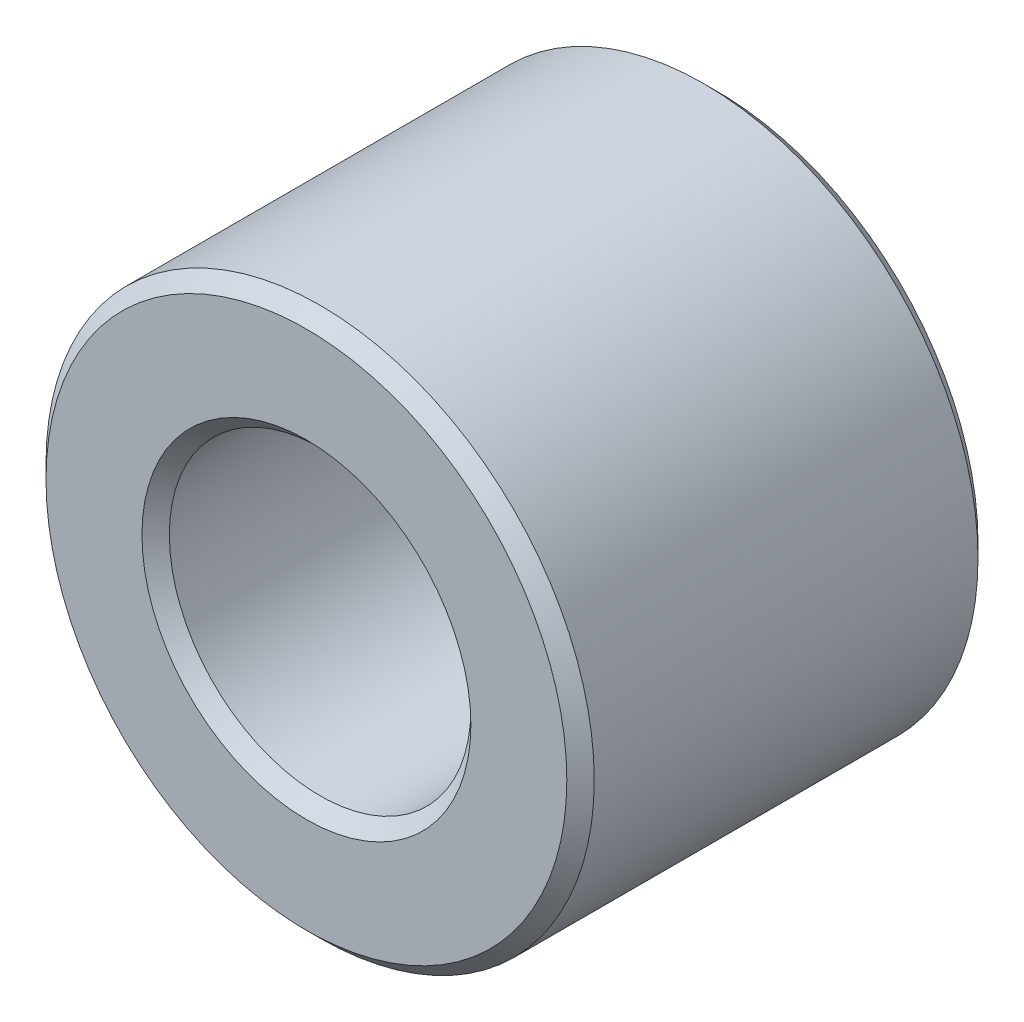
from build123d import *

# Parameters (mm, degrees)
SKETCH1_R           = 2
SKETCH1_R_2         = 1.1
BOSS_EXTRUDE2_DEPTH = 1.5
CHAMFER3_SIZE       = 0.1


with BuildPart() as part:
    # Sketch1 → Boss-Extrude2 (new, symmetric)
    with BuildSketch(Plane.XY):
        Circle(SKETCH1_R)
        Circle(SKETCH1_R_2, mode=Mode.SUBTRACT)
    extrude(amount=BOSS_EXTRUDE2_DEPTH, both=True)

    # Chamfer3
    chamfer3_edges = [part.edges().sort_by_distance(p)[0] for p in [
        (-2, 0, -1.5),
        (-2, 0, 1.5),
        (-1.1, 0, -1.5),
        (-1.1, 0, 1.5),
    ]]
    chamfer(chamfer3_edges, length=CHAMFER3_SIZE)


solid = part.part
